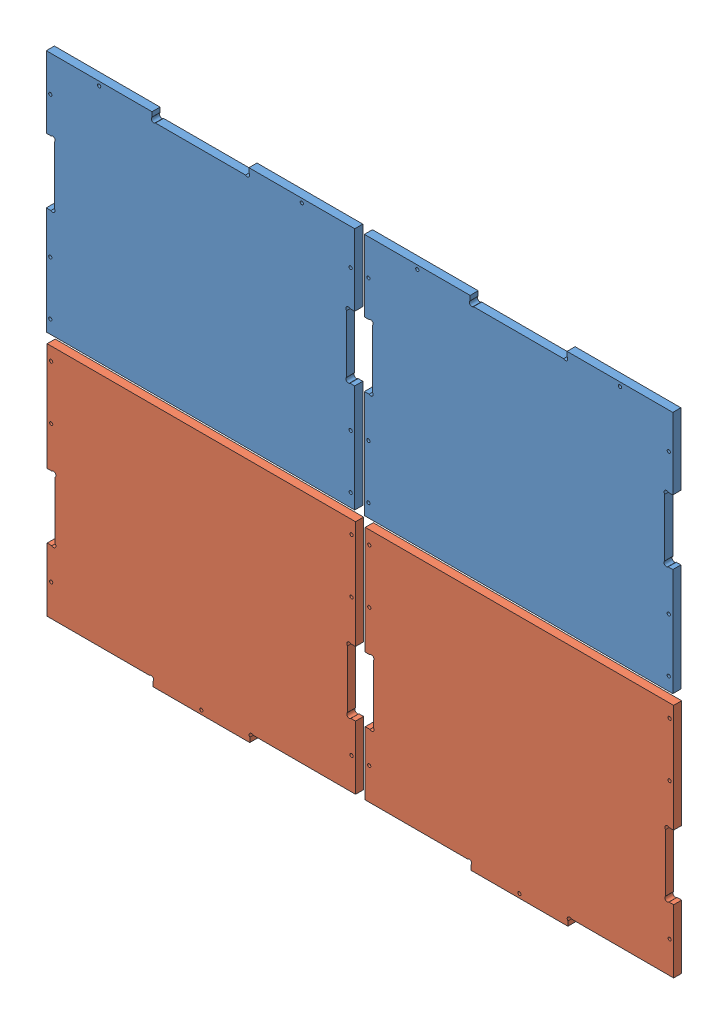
SolidWorks assembly Pièces PVC 5 rouge.SLDASM, configuration Défaut (file format 5000). Lengths in mm.
Overall size (395.16 308.09 5).
4 component instances, 2 part files, 2 mates.
Components (placement in the parent):
- Toit D déplié-1: Toit D déplié.SLDPRT [Défaut] at (-18.1854 40.8991 0) size (196.86 150.88 5)
- Toit G déplié-1: Toit G déplié.SLDPRT [Défaut] at (-17.6644 -189.0953 0) x (-1 0 0) z (0 0 1) size (196.86 151.21 5)
- Toit D déplié-2: Toit D déplié.SLDPRT [Défaut] at (178.8146 40.8991 0) size (196.86 150.88 5)
- Toit G déplié-2: Toit G déplié.SLDPRT [Défaut] at (179.3356 -189.0953 0) x (-1 0 0) z (0 0 1) size (196.86 151.21 5)
Mates (geometry in assembly coordinates):
- Coïncidente1: coincident aligned: plane of Toit D déplié-1 through (-18.1854 40.8991 5) normal (0 0 1); plane of Toit G déplié-1 through (-17.6644 -189.0953 5) normal (0 0 1)
- Distance1: distance = 6 mm anti-aligned: plane of Toit D déplié-1 through (-18.1854 -72.534 5) normal (0 -1 0); plane of Toit G déplié-1 through (-17.6644 -78.534 5) normal (0 1 0)
